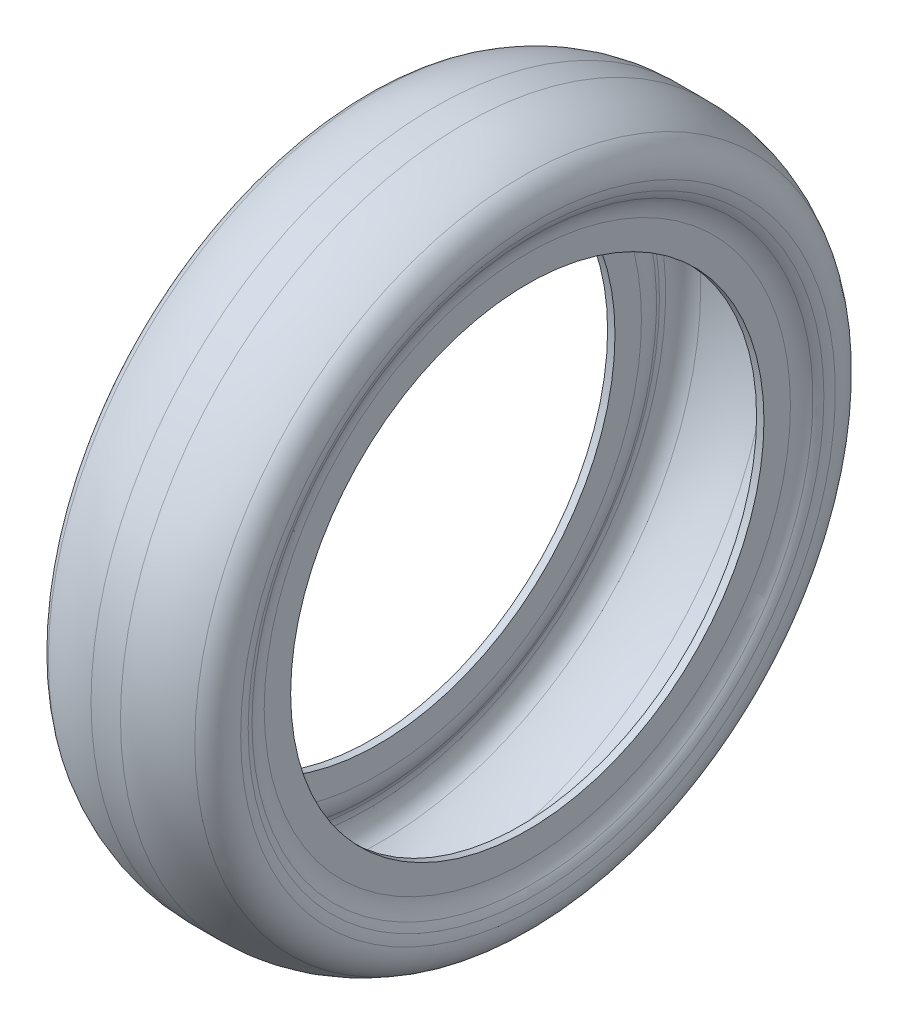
from build123d import *


with BuildPart() as part:
    # Esquisse1 → Base-R_vol.-Mince (revolve)
    with BuildSketch(Plane.XY, mode=Mode.PRIVATE) as base_r_vol_mince_sk:
        with BuildLine():
            Line((-74, 224), (-74, 249.049268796))
            ThreePointArc((-74, 249.049268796), (-75.247111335, 257.609139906), (-78.884759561, 265.457336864))
            ThreePointArc((-78.884759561, 265.457336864), (-80.799004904, 268.849764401), (-82.257566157, 272.461619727))
            ThreePointArc((-82.257566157, 272.461619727), (-83.443104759, 276.891835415), (-84.113751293, 281.428634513))
            ThreePointArc((-84.113751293, 281.428634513), (-80.888716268, 297.873165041), (-69.346580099, 310.022343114))
            ThreePointArc((-69.346580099, 310.022343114), (-42.633606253, 321.189589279), (-13.932192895, 325))
            Line((-13.932192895, 325), (13.932192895, 325))
            ThreePointArc((13.932192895, 325), (42.633606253, 321.189589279), (69.346580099, 310.022343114))
            ThreePointArc((69.346580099, 310.022343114), (80.888716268, 297.873165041), (84.113751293, 281.428634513))
            ThreePointArc((84.113751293, 281.428634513), (83.443104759, 276.891835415), (82.257566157, 272.461619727))
            ThreePointArc((82.257566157, 272.461619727), (80.799004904, 268.849764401), (78.884759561, 265.457336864))
            ThreePointArc((78.884759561, 265.457336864), (75.247111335, 257.609139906), (74, 249.049268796))
            Line((74, 249.049268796), (74, 224))
            Line((74, 224), (67, 224))
            Line((67, 224), (67, 249.049268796))
            ThreePointArc((67, 249.049268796), (68.53810398, 259.606443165), (73.024536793, 269.28588608))
            ThreePointArc((73.024536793, 269.28588608), (74.492124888, 271.886747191), (75.610355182, 274.655836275))
            ThreePointArc((75.610355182, 274.655836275), (76.588424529, 278.310764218), (77.141707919, 282.053623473))
            ThreePointArc((77.141707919, 282.053623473), (74.669181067, 294.661096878), (65.820210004, 303.975466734))
            ThreePointArc((65.820210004, 303.975466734), (40.807152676, 314.432069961), (13.932192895, 318))
            Line((13.932192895, 318), (-13.932192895, 318))
            ThreePointArc((-13.932192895, 318), (-40.807152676, 314.432069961), (-65.820210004, 303.975466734))
            ThreePointArc((-65.820210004, 303.975466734), (-74.669181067, 294.661096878), (-77.141707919, 282.053623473))
            ThreePointArc((-77.141707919, 282.053623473), (-76.588424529, 278.310764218), (-75.610355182, 274.655836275))
            ThreePointArc((-75.610355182, 274.655836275), (-74.492124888, 271.886747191), (-73.024536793, 269.28588608))
            ThreePointArc((-73.024536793, 269.28588608), (-68.53810398, 259.606443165), (-67, 249.049268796))
            Line((-67, 249.049268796), (-67, 224))
            Line((-67, 224), (-74, 224))
        make_face()
    revolve(base_r_vol_mince_sk.sketch.rotate(Axis((130.136206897, 0, 0), (1, 0, 0)), 90), axis=Axis((130.136206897, 0, 0), (1, 0, 0)))


solid = part.part
